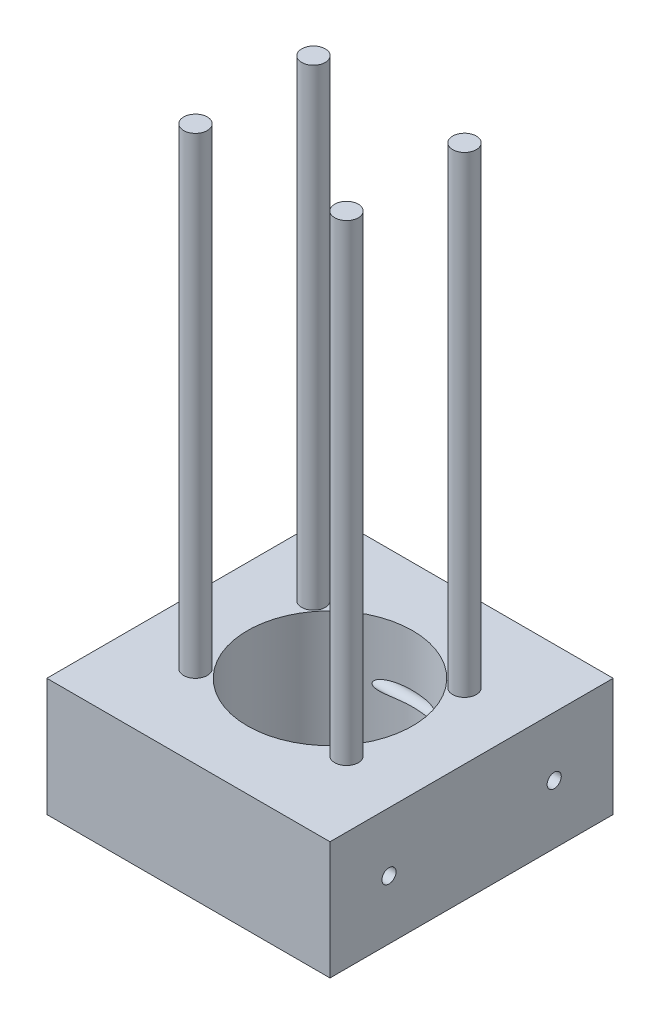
ISO-10303-21;
HEADER;
FILE_DESCRIPTION(('STEP AP214'),'2;1');
FILE_NAME('part.step','',(''),(''),'','','');
FILE_SCHEMA(('AUTOMOTIVE_DESIGN { 1 0 10303 214 1 1 1 1 }'));
ENDSEC;
DATA;
#1=APPLICATION_CONTEXT('core data for automotive mechanical design processes');
#2=APPLICATION_PROTOCOL_DEFINITION('international standard','automotive_design',2000,#1);
#3=PRODUCT_CONTEXT('',#1,'mechanical');
#4=PRODUCT('Part','Part','',(#3));
#5=PRODUCT_RELATED_PRODUCT_CATEGORY('part','',(#4));
#6=PRODUCT_DEFINITION_FORMATION('','',#4);
#7=PRODUCT_DEFINITION_CONTEXT('part definition',#1,'design');
#8=PRODUCT_DEFINITION('design','',#6,#7);
#9=PRODUCT_DEFINITION_SHAPE('','',#8);
#10=(LENGTH_UNIT() NAMED_UNIT(*) SI_UNIT(.MILLI.,.METRE.));
#11=(NAMED_UNIT(*) PLANE_ANGLE_UNIT() SI_UNIT($,.RADIAN.));
#12=(NAMED_UNIT(*) SI_UNIT($,.STERADIAN.) SOLID_ANGLE_UNIT());
#13=UNCERTAINTY_MEASURE_WITH_UNIT(LENGTH_MEASURE(1.E-05),#10,'distance_accuracy_value','');
#14=(GEOMETRIC_REPRESENTATION_CONTEXT(3) GLOBAL_UNCERTAINTY_ASSIGNED_CONTEXT((#13)) GLOBAL_UNIT_ASSIGNED_CONTEXT((#10,
#11,#12)) REPRESENTATION_CONTEXT('',''));
#15=CARTESIAN_POINT('',(0.,0.,0.));
#16=DIRECTION('',(0.,0.,1.));
#17=DIRECTION('',(1.,0.,0.));
#18=AXIS2_PLACEMENT_3D('',#15,#16,#17);
#19=CARTESIAN_POINT('',(0.,50.,120.));
#20=DIRECTION('',(0.,-1.,0.));
#21=DIRECTION('',(0.,0.,-1.));
#22=AXIS2_PLACEMENT_3D('',#19,#20,#21);
#23=PLANE('',#22);
#24=CARTESIAN_POINT('',(28.,50.,35.));
#25=DIRECTION('',(0.,-1.,0.));
#26=DIRECTION('',(0.,0.,-1.));
#27=AXIS2_PLACEMENT_3D('',#24,#25,#26);
#28=CIRCLE('',#27,5.);
#29=CARTESIAN_POINT('',(28.,50.,30.));
#30=VERTEX_POINT('',#29);
#31=EDGE_CURVE('E32',#30,#30,#28,.F.);
#32=ORIENTED_EDGE('',*,*,#31,.F.);
#33=EDGE_LOOP('',(#32));
#34=FACE_BOUND('',#33,.T.);
#35=CARTESIAN_POINT('',(92.,50.,35.));
#36=DIRECTION('',(0.,-1.,0.));
#37=DIRECTION('',(0.,0.,-1.));
#38=AXIS2_PLACEMENT_3D('',#35,#36,#37);
#39=CIRCLE('',#38,5.00000000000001);
#40=CARTESIAN_POINT('',(92.,50.,30.));
#41=VERTEX_POINT('',#40);
#42=EDGE_CURVE('E82',#41,#41,#39,.F.);
#43=ORIENTED_EDGE('',*,*,#42,.F.);
#44=EDGE_LOOP('',(#43));
#45=FACE_BOUND('',#44,.T.);
#46=CARTESIAN_POINT('',(60.,50.,60.));
#47=DIRECTION('',(0.,1.,0.));
#48=DIRECTION('',(0.,0.,1.));
#49=AXIS2_PLACEMENT_3D('',#46,#47,#48);
#50=CIRCLE('',#49,35.);
#51=CARTESIAN_POINT('',(60.,50.,95.));
#52=VERTEX_POINT('',#51);
#53=EDGE_CURVE('E90',#52,#52,#50,.T.);
#54=ORIENTED_EDGE('',*,*,#53,.F.);
#55=EDGE_LOOP('',(#54));
#56=FACE_BOUND('',#55,.T.);
#57=DIRECTION('',(-1.,0.,0.));
#58=VECTOR('',#57,1.);
#59=CARTESIAN_POINT('',(0.,50.,0.));
#60=LINE('',#59,#58);
#61=CARTESIAN_POINT('',(120.,50.,0.));
#62=VERTEX_POINT('',#61);
#63=CARTESIAN_POINT('',(0.,50.,0.));
#64=VERTEX_POINT('',#63);
#65=EDGE_CURVE('E95',#62,#64,#60,.T.);
#66=ORIENTED_EDGE('',*,*,#65,.T.);
#67=DIRECTION('',(0.,0.,-1.));
#68=VECTOR('',#67,1.);
#69=CARTESIAN_POINT('',(0.,50.,120.));
#70=LINE('',#69,#68);
#71=CARTESIAN_POINT('',(0.,50.,120.));
#72=VERTEX_POINT('',#71);
#73=EDGE_CURVE('E86',#72,#64,#70,.T.);
#74=ORIENTED_EDGE('',*,*,#73,.F.);
#75=DIRECTION('',(-1.,0.,0.));
#76=VECTOR('',#75,1.);
#77=CARTESIAN_POINT('',(0.,50.,120.));
#78=LINE('',#77,#76);
#79=CARTESIAN_POINT('',(120.,50.,120.));
#80=VERTEX_POINT('',#79);
#81=EDGE_CURVE('E39',#80,#72,#78,.T.);
#82=ORIENTED_EDGE('',*,*,#81,.F.);
#83=DIRECTION('',(0.,0.,-1.));
#84=VECTOR('',#83,1.);
#85=CARTESIAN_POINT('',(120.,50.,120.));
#86=LINE('',#85,#84);
#87=EDGE_CURVE('E103',#80,#62,#86,.T.);
#88=ORIENTED_EDGE('',*,*,#87,.T.);
#89=EDGE_LOOP('',(#66,#74,#82,#88));
#90=FACE_BOUND('',#89,.T.);
#91=CARTESIAN_POINT('',(92.,50.,85.));
#92=DIRECTION('',(0.,-1.,0.));
#93=DIRECTION('',(0.,0.,-1.));
#94=AXIS2_PLACEMENT_3D('',#91,#92,#93);
#95=CIRCLE('',#94,5.00000000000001);
#96=CARTESIAN_POINT('',(92.,50.,80.));
#97=VERTEX_POINT('',#96);
#98=EDGE_CURVE('E109',#97,#97,#95,.F.);
#99=ORIENTED_EDGE('',*,*,#98,.F.);
#100=EDGE_LOOP('',(#99));
#101=FACE_BOUND('',#100,.T.);
#102=CARTESIAN_POINT('',(28.,50.,85.));
#103=DIRECTION('',(0.,-1.,0.));
#104=DIRECTION('',(0.,0.,-1.));
#105=AXIS2_PLACEMENT_3D('',#102,#103,#104);
#106=CIRCLE('',#105,5.);
#107=CARTESIAN_POINT('',(28.,50.,80.));
#108=VERTEX_POINT('',#107);
#109=EDGE_CURVE('E11',#108,#108,#106,.F.);
#110=ORIENTED_EDGE('',*,*,#109,.F.);
#111=EDGE_LOOP('',(#110));
#112=FACE_BOUND('',#111,.T.);
#113=ADVANCED_FACE('F24',(#34,#45,#56,#90,#101,#112),#23,.F.);
#114=CARTESIAN_POINT('',(0.,0.,120.));
#115=DIRECTION('',(1.,0.,0.));
#116=DIRECTION('',(0.,0.,-1.));
#117=AXIS2_PLACEMENT_3D('',#114,#115,#116);
#118=PLANE('',#117);
#119=CARTESIAN_POINT('',(0.,25.,25.));
#120=DIRECTION('',(-1.,0.,0.));
#121=DIRECTION('',(0.,0.,-1.));
#122=AXIS2_PLACEMENT_3D('',#119,#120,#121);
#123=CIRCLE('',#122,10.);
#124=CARTESIAN_POINT('',(0.,25.,15.));
#125=VERTEX_POINT('',#124);
#126=EDGE_CURVE('E200',#125,#125,#123,.T.);
#127=ORIENTED_EDGE('',*,*,#126,.F.);
#128=EDGE_LOOP('',(#127));
#129=FACE_BOUND('',#128,.T.);
#130=CARTESIAN_POINT('',(0.,25.,95.));
#131=DIRECTION('',(-1.,0.,0.));
#132=DIRECTION('',(0.,0.,1.));
#133=AXIS2_PLACEMENT_3D('',#130,#131,#132);
#134=CIRCLE('',#133,9.99999999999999);
#135=CARTESIAN_POINT('',(0.,25.,105.));
#136=VERTEX_POINT('',#135);
#137=EDGE_CURVE('E207',#136,#136,#134,.T.);
#138=ORIENTED_EDGE('',*,*,#137,.F.);
#139=EDGE_LOOP('',(#138));
#140=FACE_BOUND('',#139,.T.);
#141=DIRECTION('',(0.,-1.,0.));
#142=VECTOR('',#141,1.);
#143=CARTESIAN_POINT('',(0.,0.,0.));
#144=LINE('',#143,#142);
#145=CARTESIAN_POINT('',(0.,0.,0.));
#146=VERTEX_POINT('',#145);
#147=EDGE_CURVE('E70',#64,#146,#144,.T.);
#148=ORIENTED_EDGE('',*,*,#147,.T.);
#149=DIRECTION('',(0.,0.,-1.));
#150=VECTOR('',#149,1.);
#151=CARTESIAN_POINT('',(0.,0.,120.));
#152=LINE('',#151,#150);
#153=CARTESIAN_POINT('',(0.,0.,120.));
#154=VERTEX_POINT('',#153);
#155=EDGE_CURVE('E77',#154,#146,#152,.T.);
#156=ORIENTED_EDGE('',*,*,#155,.F.);
#157=DIRECTION('',(0.,-1.,0.));
#158=VECTOR('',#157,1.);
#159=CARTESIAN_POINT('',(0.,0.,120.));
#160=LINE('',#159,#158);
#161=EDGE_CURVE('E97',#72,#154,#160,.T.);
#162=ORIENTED_EDGE('',*,*,#161,.F.);
#163=ORIENTED_EDGE('',*,*,#73,.T.);
#164=EDGE_LOOP('',(#148,#156,#162,#163));
#165=FACE_BOUND('',#164,.T.);
#166=ADVANCED_FACE('F26',(#129,#140,#165),#118,.F.);
#167=CARTESIAN_POINT('',(0.,0.,120.));
#168=DIRECTION('',(0.,1.,0.));
#169=DIRECTION('',(0.,0.,1.));
#170=AXIS2_PLACEMENT_3D('',#167,#168,#169);
#171=PLANE('',#170);
#172=CARTESIAN_POINT('',(60.,0.,60.));
#173=DIRECTION('',(0.,1.,0.));
#174=DIRECTION('',(0.,0.,1.));
#175=AXIS2_PLACEMENT_3D('',#172,#173,#174);
#176=CIRCLE('',#175,35.);
#177=CARTESIAN_POINT('',(60.,0.,95.));
#178=VERTEX_POINT('',#177);
#179=EDGE_CURVE('E87',#178,#178,#176,.T.);
#180=ORIENTED_EDGE('',*,*,#179,.T.);
#181=EDGE_LOOP('',(#180));
#182=FACE_BOUND('',#181,.T.);
#183=DIRECTION('',(1.,0.,0.));
#184=VECTOR('',#183,1.);
#185=CARTESIAN_POINT('',(0.,0.,0.));
#186=LINE('',#185,#184);
#187=CARTESIAN_POINT('',(120.,0.,0.));
#188=VERTEX_POINT('',#187);
#189=EDGE_CURVE('E65',#146,#188,#186,.T.);
#190=ORIENTED_EDGE('',*,*,#189,.T.);
#191=DIRECTION('',(0.,0.,-1.));
#192=VECTOR('',#191,1.);
#193=CARTESIAN_POINT('',(120.,0.,120.));
#194=LINE('',#193,#192);
#195=CARTESIAN_POINT('',(120.,0.,120.));
#196=VERTEX_POINT('',#195);
#197=EDGE_CURVE('E83',#196,#188,#194,.T.);
#198=ORIENTED_EDGE('',*,*,#197,.F.);
#199=DIRECTION('',(1.,0.,0.));
#200=VECTOR('',#199,1.);
#201=CARTESIAN_POINT('',(0.,0.,120.));
#202=LINE('',#201,#200);
#203=EDGE_CURVE('E79',#154,#196,#202,.T.);
#204=ORIENTED_EDGE('',*,*,#203,.F.);
#205=ORIENTED_EDGE('',*,*,#155,.T.);
#206=EDGE_LOOP('',(#190,#198,#204,#205));
#207=FACE_BOUND('',#206,.T.);
#208=ADVANCED_FACE('F78',(#182,#207),#171,.F.);
#209=CARTESIAN_POINT('',(120.,0.,120.));
#210=DIRECTION('',(-1.,0.,0.));
#211=DIRECTION('',(0.,0.,1.));
#212=AXIS2_PLACEMENT_3D('',#209,#210,#211);
#213=PLANE('',#212);
#214=CARTESIAN_POINT('',(120.,25.,95.));
#215=DIRECTION('',(-1.,0.,0.));
#216=DIRECTION('',(0.,0.,1.));
#217=AXIS2_PLACEMENT_3D('',#214,#215,#216);
#218=CIRCLE('',#217,3.00000000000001);
#219=CARTESIAN_POINT('',(120.,25.,98.));
#220=VERTEX_POINT('',#219);
#221=EDGE_CURVE('E181',#220,#220,#218,.T.);
#222=ORIENTED_EDGE('',*,*,#221,.T.);
#223=EDGE_LOOP('',(#222));
#224=FACE_BOUND('',#223,.T.);
#225=CARTESIAN_POINT('',(120.,25.,25.));
#226=DIRECTION('',(-1.,0.,0.));
#227=DIRECTION('',(0.,0.,1.));
#228=AXIS2_PLACEMENT_3D('',#225,#226,#227);
#229=CIRCLE('',#228,3.);
#230=CARTESIAN_POINT('',(120.,25.,28.));
#231=VERTEX_POINT('',#230);
#232=EDGE_CURVE('E201',#231,#231,#229,.T.);
#233=ORIENTED_EDGE('',*,*,#232,.T.);
#234=EDGE_LOOP('',(#233));
#235=FACE_BOUND('',#234,.T.);
#236=DIRECTION('',(0.,1.,0.));
#237=VECTOR('',#236,1.);
#238=CARTESIAN_POINT('',(120.,0.,0.));
#239=LINE('',#238,#237);
#240=EDGE_CURVE('E71',#188,#62,#239,.T.);
#241=ORIENTED_EDGE('',*,*,#240,.T.);
#242=ORIENTED_EDGE('',*,*,#87,.F.);
#243=DIRECTION('',(0.,1.,0.));
#244=VECTOR('',#243,1.);
#245=CARTESIAN_POINT('',(120.,0.,120.));
#246=LINE('',#245,#244);
#247=EDGE_CURVE('E44',#196,#80,#246,.T.);
#248=ORIENTED_EDGE('',*,*,#247,.F.);
#249=ORIENTED_EDGE('',*,*,#197,.T.);
#250=EDGE_LOOP('',(#241,#242,#248,#249));
#251=FACE_BOUND('',#250,.T.);
#252=ADVANCED_FACE('F226',(#224,#235,#251),#213,.F.);
#253=CARTESIAN_POINT('',(0.,50.,120.));
#254=DIRECTION('',(0.,0.,-1.));
#255=DIRECTION('',(-1.,0.,0.));
#256=AXIS2_PLACEMENT_3D('',#253,#254,#255);
#257=PLANE('',#256);
#258=ORIENTED_EDGE('',*,*,#161,.T.);
#259=ORIENTED_EDGE('',*,*,#203,.T.);
#260=ORIENTED_EDGE('',*,*,#247,.T.);
#261=ORIENTED_EDGE('',*,*,#81,.T.);
#262=EDGE_LOOP('',(#258,#259,#260,#261));
#263=FACE_BOUND('',#262,.T.);
#264=ADVANCED_FACE('F288',(#263),#257,.F.);
#265=CARTESIAN_POINT('',(0.,50.,0.));
#266=DIRECTION('',(0.,0.,-1.));
#267=DIRECTION('',(-1.,0.,0.));
#268=AXIS2_PLACEMENT_3D('',#265,#266,#267);
#269=PLANE('',#268);
#270=ORIENTED_EDGE('',*,*,#147,.F.);
#271=ORIENTED_EDGE('',*,*,#65,.F.);
#272=ORIENTED_EDGE('',*,*,#240,.F.);
#273=ORIENTED_EDGE('',*,*,#189,.F.);
#274=EDGE_LOOP('',(#270,#271,#272,#273));
#275=FACE_BOUND('',#274,.T.);
#276=ADVANCED_FACE('F67',(#275),#269,.T.);
#277=CARTESIAN_POINT('',(60.,0.,60.));
#278=DIRECTION('',(0.,1.,0.));
#279=DIRECTION('',(0.,0.,1.));
#280=AXIS2_PLACEMENT_3D('',#277,#278,#279);
#281=CYLINDRICAL_SURFACE('',#280,35.);
#282=CARTESIAN_POINT('',(60.,22.,95.));
#283=CARTESIAN_POINT('',(60.501205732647,21.9999918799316,94.9999995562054));
#284=CARTESIAN_POINT('',(61.0024392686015,21.9999400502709,94.989231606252));
#285=CARTESIAN_POINT('',(62.0040108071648,22.0004076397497,94.9461761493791));
#286=CARTESIAN_POINT('',(62.5043487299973,22.000927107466,94.913886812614));
#287=CARTESIAN_POINT('',(63.5057428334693,22.0046433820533,94.8276274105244));
#288=CARTESIAN_POINT('',(64.0067894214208,22.0078539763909,94.7735464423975));
#289=CARTESIAN_POINT('',(65.0059099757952,22.020501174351,94.6438234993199));
#290=CARTESIAN_POINT('',(65.5039847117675,22.0299360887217,94.5681873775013));
#291=CARTESIAN_POINT('',(66.2504415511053,22.0527265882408,94.4383017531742));
#292=CARTESIAN_POINT('',(66.5003580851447,22.0618284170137,94.3920035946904));
#293=CARTESIAN_POINT('',(66.9989587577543,22.0838194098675,94.2940098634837));
#294=CARTESIAN_POINT('',(67.2476429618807,22.0967083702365,94.2423145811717));
#295=CARTESIAN_POINT('',(67.743875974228,22.1273001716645,94.1335171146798));
#296=CARTESIAN_POINT('',(67.9914228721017,22.1450092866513,94.0764079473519));
#297=CARTESIAN_POINT('',(68.4847347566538,22.1864570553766,93.9569385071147));
#298=CARTESIAN_POINT('',(68.7304998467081,22.2101953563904,93.8945785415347));
#299=CARTESIAN_POINT('',(69.2174349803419,22.2649278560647,93.7653922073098));
#300=CARTESIAN_POINT('',(69.4586264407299,22.2958482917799,93.6986158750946));
#301=CARTESIAN_POINT('',(69.9383605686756,22.3668996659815,93.560263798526));
#302=CARTESIAN_POINT('',(70.1769025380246,22.407032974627,93.4886868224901));
#303=CARTESIAN_POINT('',(70.6498162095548,22.4987499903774,93.3413048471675));
#304=CARTESIAN_POINT('',(70.8841967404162,22.5503052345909,93.2655107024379));
#305=CARTESIAN_POINT('',(71.3479393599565,22.6680243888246,93.110178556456));
#306=CARTESIAN_POINT('',(71.57730497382,22.7341776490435,93.0306433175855));
#307=CARTESIAN_POINT('',(71.8835423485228,22.8368810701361,92.9209473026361));
#308=CARTESIAN_POINT('',(71.963630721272,22.8651127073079,92.8919247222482));
#309=CARTESIAN_POINT('',(72.1227067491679,22.9242929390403,92.833628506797));
#310=CARTESIAN_POINT('',(72.2016943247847,22.9552417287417,92.8043548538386));
#311=CARTESIAN_POINT('',(72.4374786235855,23.0529087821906,92.716009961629));
#312=CARTESIAN_POINT('',(72.592359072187,23.1242068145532,92.6566794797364));
#313=CARTESIAN_POINT('',(72.8386176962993,23.2529307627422,92.5604114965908));
#314=CARTESIAN_POINT('',(72.9323299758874,23.3057601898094,92.5232935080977));
#315=CARTESIAN_POINT('',(73.1157704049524,23.4186154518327,92.4497506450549));
#316=CARTESIAN_POINT('',(73.2054955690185,23.478646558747,92.413326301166));
#317=CARTESIAN_POINT('',(73.3788317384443,23.6067145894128,92.3421641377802));
#318=CARTESIAN_POINT('',(73.4624784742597,23.6746973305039,92.3074169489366));
#319=CARTESIAN_POINT('',(73.6219234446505,23.8203226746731,92.2405123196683));
#320=CARTESIAN_POINT('',(73.6977374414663,23.8979451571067,92.2083497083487));
#321=CARTESIAN_POINT('',(73.8201362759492,24.0429903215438,92.1559804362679));
#322=CARTESIAN_POINT('',(73.8692323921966,24.1079283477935,92.1348221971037));
#323=CARTESIAN_POINT('',(73.9591588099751,24.2443514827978,92.0958608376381));
#324=CARTESIAN_POINT('',(73.9999879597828,24.3158375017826,92.0780581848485));
#325=CARTESIAN_POINT('',(74.0711412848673,24.4659604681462,92.0469112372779));
#326=CARTESIAN_POINT('',(74.1013379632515,24.544670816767,92.0336211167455));
#327=CARTESIAN_POINT('',(74.1475498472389,24.7069108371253,92.013239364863));
#328=CARTESIAN_POINT('',(74.1635901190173,24.7904317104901,92.0061367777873));
#329=CARTESIAN_POINT('',(74.1787691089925,24.9513948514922,91.9994151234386));
#330=CARTESIAN_POINT('',(74.1793506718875,25.0286733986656,91.9991572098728));
#331=CARTESIAN_POINT('',(74.1671934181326,25.1819681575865,92.0045414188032));
#332=CARTESIAN_POINT('',(74.1544504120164,25.2579839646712,92.0101853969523));
#333=CARTESIAN_POINT('',(74.1188616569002,25.399080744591,92.0258968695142));
#334=CARTESIAN_POINT('',(74.0971217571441,25.4645053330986,92.035479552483));
#335=CARTESIAN_POINT('',(74.0454828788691,25.5913498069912,92.058153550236));
#336=CARTESIAN_POINT('',(74.015582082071,25.6527687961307,92.0712456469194));
#337=CARTESIAN_POINT('',(73.9267199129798,25.8112835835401,92.1099690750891));
#338=CARTESIAN_POINT('',(73.8617826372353,25.9044086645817,92.1380918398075));
#339=CARTESIAN_POINT('',(73.7193800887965,26.0787863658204,92.1991404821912));
#340=CARTESIAN_POINT('',(73.641874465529,26.1599990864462,92.2320817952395));
#341=CARTESIAN_POINT('',(73.4865449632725,26.3043612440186,92.2973605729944));
#342=CARTESIAN_POINT('',(73.4095159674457,26.3685034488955,92.3294335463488));
#343=CARTESIAN_POINT('',(73.2504168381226,26.4894760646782,92.3949666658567));
#344=CARTESIAN_POINT('',(73.1683424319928,26.5463001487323,92.4284279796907));
#345=CARTESIAN_POINT('',(73.0003315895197,26.6537101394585,92.4961474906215));
#346=CARTESIAN_POINT('',(72.9143885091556,26.704284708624,92.53040700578));
#347=CARTESIAN_POINT('',(72.7396750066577,26.7999299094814,92.599225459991));
#348=CARTESIAN_POINT('',(72.6509054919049,26.8450022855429,92.6337843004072));
#349=CARTESIAN_POINT('',(72.4364814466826,26.9468426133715,92.7162301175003));
#350=CARTESIAN_POINT('',(72.3097935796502,27.0014255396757,92.7641219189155));
#351=CARTESIAN_POINT('',(72.0531926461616,27.1030018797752,92.8593868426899));
#352=CARTESIAN_POINT('',(71.9232781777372,27.1499919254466,92.9067597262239));
#353=CARTESIAN_POINT('',(71.660796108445,27.2376044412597,93.000686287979));
#354=CARTESIAN_POINT('',(71.5282247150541,27.2782169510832,93.0472385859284));
#355=CARTESIAN_POINT('',(71.2611252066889,27.3539315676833,93.139206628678));
#356=CARTESIAN_POINT('',(71.1265968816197,27.3890330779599,93.1846222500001));
#357=CARTESIAN_POINT('',(70.8553421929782,27.4546317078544,93.2743452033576));
#358=CARTESIAN_POINT('',(70.7186085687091,27.4851069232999,93.3186464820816));
#359=CARTESIAN_POINT('',(70.4438232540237,27.541893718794,93.4057979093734));
#360=CARTESIAN_POINT('',(70.3057715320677,27.5682051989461,93.4486480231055));
#361=CARTESIAN_POINT('',(70.0286917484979,27.6171712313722,93.532764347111));
#362=CARTESIAN_POINT('',(69.8896647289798,27.6398292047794,93.574032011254));
#363=CARTESIAN_POINT('',(69.6106662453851,27.6819659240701,93.6549579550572));
#364=CARTESIAN_POINT('',(69.4706947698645,27.7014446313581,93.6946162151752));
#365=CARTESIAN_POINT('',(69.1290510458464,27.7454554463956,93.7891110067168));
#366=CARTESIAN_POINT('',(68.9269458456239,27.7685156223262,93.8430712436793));
#367=CARTESIAN_POINT('',(68.5213364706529,27.8098614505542,93.9474697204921));
#368=CARTESIAN_POINT('',(68.3178321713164,27.8281466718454,93.9979076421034));
#369=CARTESIAN_POINT('',(67.705438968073,27.8770805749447,94.1438473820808));
#370=CARTESIAN_POINT('',(67.2947744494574,27.9017949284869,94.2339461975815));
#371=CARTESIAN_POINT('',(66.4693172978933,27.9405100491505,94.3994988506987));
#372=CARTESIAN_POINT('',(66.0545186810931,27.9544919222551,94.4749266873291));
#373=CARTESIAN_POINT('',(65.2223644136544,27.9754345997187,94.6107585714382));
#374=CARTESIAN_POINT('',(64.8050091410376,27.9823964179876,94.6711647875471));
#375=CARTESIAN_POINT('',(63.967123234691,27.9921742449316,94.7770151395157));
#376=CARTESIAN_POINT('',(63.5465868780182,27.9949780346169,94.8224148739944));
#377=CARTESIAN_POINT('',(62.704126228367,27.9985018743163,94.8979450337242));
#378=CARTESIAN_POINT('',(62.2822018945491,27.9992218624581,94.9280750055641));
#379=CARTESIAN_POINT('',(61.4380566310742,27.999962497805,94.9729956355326));
#380=CARTESIAN_POINT('',(61.0158367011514,27.9999840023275,94.9878050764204));
#381=CARTESIAN_POINT('',(60.1711436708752,28.0000075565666,95.0021304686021));
#382=CARTESIAN_POINT('',(59.7486705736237,28.0000096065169,95.0016466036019));
#383=CARTESIAN_POINT('',(58.8811225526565,27.999975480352,94.984945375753));
#384=CARTESIAN_POINT('',(58.4360637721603,27.9999372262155,94.9678766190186));
#385=CARTESIAN_POINT('',(57.5469019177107,27.9989537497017,94.9167671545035));
#386=CARTESIAN_POINT('',(57.1027988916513,27.9980084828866,94.8827256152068));
#387=CARTESIAN_POINT('',(56.2151710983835,27.9934705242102,94.7976193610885));
#388=CARTESIAN_POINT('',(55.7716502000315,27.9898715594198,94.7465144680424));
#389=CARTESIAN_POINT('',(54.8870076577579,27.9773732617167,94.6273950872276));
#390=CARTESIAN_POINT('',(54.4458857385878,27.9684745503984,94.5593825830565));
#391=CARTESIAN_POINT('',(53.5703979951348,27.9418608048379,94.4072075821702));
#392=CARTESIAN_POINT('',(53.1360064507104,27.9242190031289,94.3231827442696));
#393=CARTESIAN_POINT('',(52.4874817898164,27.8875501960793,94.1849527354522));
#394=CARTESIAN_POINT('',(52.2717500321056,27.8736202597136,94.1368268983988));
#395=CARTESIAN_POINT('',(51.8415353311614,27.841581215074,94.0365718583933));
#396=CARTESIAN_POINT('',(51.6270523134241,27.8234723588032,93.9844428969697));
#397=CARTESIAN_POINT('',(51.2004615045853,27.7822725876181,93.8764863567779));
#398=CARTESIAN_POINT('',(50.9883475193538,27.7592029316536,93.8206752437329));
#399=CARTESIAN_POINT('',(50.5659155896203,27.7069756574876,93.7052811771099));
#400=CARTESIAN_POINT('',(50.3555974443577,27.6778187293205,93.6456986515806));
#401=CARTESIAN_POINT('',(49.9373756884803,27.612142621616,93.5229926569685));
#402=CARTESIAN_POINT('',(49.729469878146,27.5756308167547,93.4598727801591));
#403=CARTESIAN_POINT('',(49.3165130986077,27.4936003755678,93.330314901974));
#404=CARTESIAN_POINT('',(49.1114612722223,27.4480845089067,93.2638779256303));
#405=CARTESIAN_POINT('',(48.8206329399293,27.3749451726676,93.1667048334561));
#406=CARTESIAN_POINT('',(48.7333140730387,27.3518586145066,93.1371427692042));
#407=CARTESIAN_POINT('',(48.559484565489,27.303386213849,93.0775308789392));
#408=CARTESIAN_POINT('',(48.4729739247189,27.278000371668,93.0474810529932));
#409=CARTESIAN_POINT('',(48.2146980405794,27.1980005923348,92.956637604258));
#410=CARTESIAN_POINT('',(48.0443165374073,27.139575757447,92.8951927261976));
#411=CARTESIAN_POINT('',(47.7087495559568,27.0101926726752,92.7712842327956));
#412=CARTESIAN_POINT('',(47.5435613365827,26.9392411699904,92.7088211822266));
#413=CARTESIAN_POINT('',(47.3016362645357,26.8209337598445,92.615319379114));
#414=CARTESIAN_POINT('',(47.2220084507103,26.7795411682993,92.584199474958));
#415=CARTESIAN_POINT('',(47.0651652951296,26.6922341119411,92.5222561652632));
#416=CARTESIAN_POINT('',(46.9879492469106,26.6463209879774,92.491432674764));
#417=CARTESIAN_POINT('',(46.8355211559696,26.5486610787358,92.429975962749));
#418=CARTESIAN_POINT('',(46.7603510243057,26.4968430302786,92.3993511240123));
#419=CARTESIAN_POINT('',(46.6141433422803,26.3871394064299,92.3392189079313));
#420=CARTESIAN_POINT('',(46.5431029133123,26.3292581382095,92.3097107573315));
#421=CARTESIAN_POINT('',(46.4069412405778,26.2069206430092,92.2526613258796));
#422=CARTESIAN_POINT('',(46.3417834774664,26.1425111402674,92.2251081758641));
#423=CARTESIAN_POINT('',(46.21893148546,26.0060086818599,92.1727616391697));
#424=CARTESIAN_POINT('',(46.1612234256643,25.933930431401,92.1479631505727));
#425=CARTESIAN_POINT('',(46.0654143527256,25.7950596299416,92.1065343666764));
#426=CARTESIAN_POINT('',(46.0256525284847,25.7296269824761,92.0892364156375));
#427=CARTESIAN_POINT('',(45.9550561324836,25.5931902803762,92.0584004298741));
#428=CARTESIAN_POINT('',(45.9242205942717,25.522186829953,92.0448619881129));
#429=CARTESIAN_POINT('',(45.8735440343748,25.3747296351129,92.0225550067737));
#430=CARTESIAN_POINT('',(45.8538160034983,25.2982285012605,92.0138355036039));
#431=CARTESIAN_POINT('',(45.8279098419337,25.1425396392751,92.0023761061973));
#432=CARTESIAN_POINT('',(45.8217159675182,25.0633551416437,91.9996292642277));
#433=CARTESIAN_POINT('',(45.8234906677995,24.9124764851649,92.0004152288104));
#434=CARTESIAN_POINT('',(45.8302125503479,24.8407613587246,92.00339525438));
#435=CARTESIAN_POINT('',(45.8547173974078,24.6996346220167,92.0142336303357));
#436=CARTESIAN_POINT('',(45.8725077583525,24.6302245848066,92.0220952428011));
#437=CARTESIAN_POINT('',(45.9234710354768,24.4778995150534,92.0445358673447));
#438=CARTESIAN_POINT('',(45.959423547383,24.3961028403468,92.0603225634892));
#439=CARTESIAN_POINT('',(46.042955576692,24.2398969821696,92.0967754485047));
#440=CARTESIAN_POINT('',(46.090558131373,24.1655028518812,92.1174513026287));
#441=CARTESIAN_POINT('',(46.2242471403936,23.9833395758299,92.1750909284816));
#442=CARTESIAN_POINT('',(46.3166893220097,23.8810848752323,92.2145686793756));
#443=CARTESIAN_POINT('',(46.5146958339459,23.6924651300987,92.297960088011));
#444=CARTESIAN_POINT('',(46.6202931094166,23.6061413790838,92.3418848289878));
#445=CARTESIAN_POINT('',(46.8381295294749,23.4478905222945,92.4311394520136));
#446=CARTESIAN_POINT('',(46.9502298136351,23.375748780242,92.4764340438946));
#447=CARTESIAN_POINT('',(47.180158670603,23.2417657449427,92.5678831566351));
#448=CARTESIAN_POINT('',(47.2979928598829,23.179934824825,92.6140384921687));
#449=CARTESIAN_POINT('',(47.5379745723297,23.064729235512,92.7064901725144));
#450=CARTESIAN_POINT('',(47.6601308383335,23.0113730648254,92.7527866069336));
#451=CARTESIAN_POINT('',(47.9074360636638,22.9119103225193,92.8448979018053));
#452=CARTESIAN_POINT('',(48.0325837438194,22.8658007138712,92.890712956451));
#453=CARTESIAN_POINT('',(48.3514072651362,22.7571381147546,93.0053342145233));
#454=CARTESIAN_POINT('',(48.5466450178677,22.6986213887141,93.0736143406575));
#455=CARTESIAN_POINT('',(48.9410578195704,22.5928256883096,93.2075781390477));
#456=CARTESIAN_POINT('',(49.1402347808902,22.5455523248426,93.2732605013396));
#457=CARTESIAN_POINT('',(49.5418326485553,22.4600625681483,93.4016654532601));
#458=CARTESIAN_POINT('',(49.7442585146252,22.4218617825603,93.4643827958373));
#459=CARTESIAN_POINT('',(50.1513925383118,22.3529630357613,93.5864572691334));
#460=CARTESIAN_POINT('',(50.3561009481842,22.3222659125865,93.6458140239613));
#461=CARTESIAN_POINT('',(50.7682222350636,22.2669531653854,93.761224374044));
#462=CARTESIAN_POINT('',(50.9756429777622,22.242364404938,93.8172625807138));
#463=CARTESIAN_POINT('',(51.3919958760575,22.1983660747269,93.9256325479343));
#464=CARTESIAN_POINT('',(51.6009280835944,22.1789566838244,93.9779641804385));
#465=CARTESIAN_POINT('',(52.0198540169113,22.1444440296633,94.0787858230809));
#466=CARTESIAN_POINT('',(52.2298465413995,22.1293366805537,94.1272794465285));
#467=CARTESIAN_POINT('',(52.6509063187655,22.1026557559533,94.2204225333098));
#468=CARTESIAN_POINT('',(52.8619735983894,22.0910822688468,94.2650719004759));
#469=CARTESIAN_POINT('',(53.3584946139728,22.0673085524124,94.3653158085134));
#470=CARTESIAN_POINT('',(53.6443253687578,22.0562865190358,94.419326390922));
#471=CARTESIAN_POINT('',(54.2173676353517,22.0381698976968,94.5202232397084));
#472=CARTESIAN_POINT('',(54.5045791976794,22.0310754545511,94.5671092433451));
#473=CARTESIAN_POINT('',(55.0802316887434,22.0197313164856,94.6537245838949));
#474=CARTESIAN_POINT('',(55.3686729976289,22.0154825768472,94.6934515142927));
#475=CARTESIAN_POINT('',(55.946490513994,22.0089436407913,94.7656991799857));
#476=CARTESIAN_POINT('',(56.235866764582,22.0066535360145,94.7982195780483));
#477=CARTESIAN_POINT('',(56.8142138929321,22.0033232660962,94.8559161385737));
#478=CARTESIAN_POINT('',(57.1031819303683,22.0022782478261,94.8811205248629));
#479=CARTESIAN_POINT('',(57.6816439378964,22.0008764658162,94.9243374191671));
#480=CARTESIAN_POINT('',(57.9711378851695,22.0005196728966,94.9423502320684));
#481=CARTESIAN_POINT('',(58.5504393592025,22.0001035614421,94.9711718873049));
#482=CARTESIAN_POINT('',(58.840246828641,22.0000441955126,94.9819818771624));
#483=CARTESIAN_POINT('',(59.4200330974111,21.999994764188,94.99639602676));
#484=CARTESIAN_POINT('',(59.7100118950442,22.0000046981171,95.0000002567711));
#485=CARTESIAN_POINT('',(60.,22.,95.));
#486=B_SPLINE_CURVE_WITH_KNOTS('',3,(#282,#283,#284,#285,#286,#287,#288,#289,#290,#291,#292,
#293,#294,#295,#296,#297,#298,#299,#300,#301,#302,#303,#304,#305,#306,#307,#308,#309,#310,#311,
#312,#313,#314,#315,#316,#317,#318,#319,#320,#321,#322,#323,#324,#325,#326,#327,#328,#329,#330,
#331,#332,#333,#334,#335,#336,#337,#338,#339,#340,#341,#342,#343,#344,#345,#346,#347,#348,#349,
#350,#351,#352,#353,#354,#355,#356,#357,#358,#359,#360,#361,#362,#363,#364,#365,#366,#367,#368,
#369,#370,#371,#372,#373,#374,#375,#376,#377,#378,#379,#380,#381,#382,#383,#384,#385,#386,#387,
#388,#389,#390,#391,#392,#393,#394,#395,#396,#397,#398,#399,#400,#401,#402,#403,#404,#405,#406,
#407,#408,#409,#410,#411,#412,#413,#414,#415,#416,#417,#418,#419,#420,#421,#422,#423,#424,#425,
#426,#427,#428,#429,#430,#431,#432,#433,#434,#435,#436,#437,#438,#439,#440,#441,#442,#443,#444,
#445,#446,#447,#448,#449,#450,#451,#452,#453,#454,#455,#456,#457,#458,#459,#460,#461,#462,#463,
#464,#465,#466,#467,#468,#469,#470,#471,#472,#473,#474,#475,#476,#477,#478,#479,#480,#481,#482,
#483,#484,#485),.UNSPECIFIED.,.T.,.F.,(4,2,2,2,2,2,2,2,2,2,2,2,2,2,2,2,2,2,2,2,2,2,2,2,2,2,2,2,
2,2,2,2,2,2,2,2,2,2,2,2,2,2,2,2,2,2,2,2,2,2,2,2,2,2,2,2,2,2,2,2,2,2,2,2,2,2,2,2,2,2,2,2,2,2,2,2,
2,2,2,2,2,2,2,2,2,2,2,2,2,2,2,2,2,2,2,2,2,2,2,2,2,4),(0.,1.50355063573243,3.00722912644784,
4.51865884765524,6.02967854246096,6.79260284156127,7.55548611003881,8.31936713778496,
9.08320348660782,9.8395171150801,10.5960255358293,11.3506695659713,12.1047648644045,
12.3739453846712,12.643145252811,13.1840006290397,13.5251786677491,13.8666080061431,
14.205833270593,14.5443620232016,14.7961273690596,15.0479277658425,15.3026522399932,
15.5569247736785,15.7873720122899,16.0178917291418,16.2259413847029,16.4340374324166,
16.7828996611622,17.1329049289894,17.4481761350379,17.76371810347,18.0798243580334,
18.3958301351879,18.8335937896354,19.271551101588,19.7101857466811,20.1488678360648,
20.5895661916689,21.030275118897,21.4705689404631,21.9108681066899,22.5421150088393,
23.1734188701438,24.4363542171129,25.7015078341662,26.9664786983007,28.2351595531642,
29.5038780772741,30.7710393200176,32.0381853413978,33.3740155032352,34.7099111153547,
36.0489747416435,37.3878813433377,38.715758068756,39.380114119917,40.0444301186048,
40.7059540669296,41.367403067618,42.0281921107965,42.6887782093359,42.9738530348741,
43.2589278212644,43.8294915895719,44.3997489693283,44.6845980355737,44.9693628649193,
45.2580264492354,45.5464863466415,45.8330106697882,46.1189951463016,46.3538360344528,
46.5886514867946,46.8258143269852,47.062701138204,47.2778639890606,47.4931707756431,
47.7638568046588,48.0350824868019,48.4628253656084,48.8916618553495,49.3134005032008,
49.7355609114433,50.1586305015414,50.581522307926,51.2259033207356,51.8706052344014,
52.516408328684,53.162283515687,53.8109507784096,54.4596404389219,55.1077119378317,
55.7557996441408,56.6289595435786,57.5021516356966,58.375636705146,59.2491626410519,
60.1192724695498,60.9893454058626,61.8592796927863,62.7292054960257),.UNSPECIFIED.);
#487=CARTESIAN_POINT('',(60.,22.,95.));
#488=VERTEX_POINT('',#487);
#489=EDGE_CURVE('E173',#488,#488,#486,.T.);
#490=ORIENTED_EDGE('',*,*,#489,.T.);
#491=EDGE_LOOP('',(#490));
#492=FACE_BOUND('',#491,.T.);
#493=CARTESIAN_POINT('',(74.1774468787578,25.,28.));
#494=CARTESIAN_POINT('',(74.1774294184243,24.9257420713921,27.9999917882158));
#495=CARTESIAN_POINT('',(74.1711473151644,24.8513627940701,27.997206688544));
#496=CARTESIAN_POINT('',(74.1466316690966,24.7049051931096,27.9863626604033));
#497=CARTESIAN_POINT('',(74.1283630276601,24.6328342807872,27.9782882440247));
#498=CARTESIAN_POINT('',(74.0764010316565,24.4775086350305,27.9554077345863));
#499=CARTESIAN_POINT('',(74.0402066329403,24.3952590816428,27.9395149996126));
#500=CARTESIAN_POINT('',(73.9560989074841,24.2382843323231,27.9028130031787));
#501=CARTESIAN_POINT('',(73.9081689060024,24.163570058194,27.8819967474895));
#502=CARTESIAN_POINT('',(73.7737951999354,23.9809928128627,27.8240699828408));
#503=CARTESIAN_POINT('',(73.681013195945,23.8786448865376,27.7844543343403));
#504=CARTESIAN_POINT('',(73.4823091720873,23.6898713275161,27.7007882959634));
#505=CARTESIAN_POINT('',(73.3763525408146,23.6034891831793,27.6567262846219));
#506=CARTESIAN_POINT('',(73.1576873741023,23.4450704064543,27.567161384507));
#507=CARTESIAN_POINT('',(73.0451090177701,23.3728320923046,27.5216914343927));
#508=CARTESIAN_POINT('',(72.8142148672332,23.23869693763,27.4299006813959));
#509=CARTESIAN_POINT('',(72.6958934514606,23.1768105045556,27.3835790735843));
#510=CARTESIAN_POINT('',(72.4549585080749,23.061536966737,27.2908161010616));
#511=CARTESIAN_POINT('',(72.3323371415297,23.0081664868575,27.2443746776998));
#512=CARTESIAN_POINT('',(72.0840996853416,22.9086949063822,27.1519850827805));
#513=CARTESIAN_POINT('',(71.9584848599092,22.8625907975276,27.1060367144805));
#514=CARTESIAN_POINT('',(71.6383802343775,22.7539272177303,26.9910580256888));
#515=CARTESIAN_POINT('',(71.4423249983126,22.6954215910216,26.9225627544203));
#516=CARTESIAN_POINT('',(71.0462725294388,22.589682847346,26.7881999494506));
#517=CARTESIAN_POINT('',(70.8462733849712,22.5424553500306,26.7223337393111));
#518=CARTESIAN_POINT('',(70.4430314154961,22.4570823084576,26.5935939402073));
#519=CARTESIAN_POINT('',(70.2397836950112,22.4189521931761,26.5307255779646));
#520=CARTESIAN_POINT('',(69.8310039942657,22.3502108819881,26.4083805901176));
#521=CARTESIAN_POINT('',(69.625471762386,22.3196005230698,26.3489043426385));
#522=CARTESIAN_POINT('',(69.2114975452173,22.2644432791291,26.2332301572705));
#523=CARTESIAN_POINT('',(69.0030459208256,22.239929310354,26.1770512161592));
#524=CARTESIAN_POINT('',(68.5846316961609,22.1960996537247,26.0684390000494));
#525=CARTESIAN_POINT('',(68.3746690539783,22.176784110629,26.0160058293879));
#526=CARTESIAN_POINT('',(67.7432729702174,22.125285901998,25.8645505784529));
#527=CARTESIAN_POINT('',(67.3199304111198,22.0995020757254,25.7712606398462));
#528=CARTESIAN_POINT('',(66.4336837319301,22.0576954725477,25.5931840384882));
#529=CARTESIAN_POINT('',(65.9704595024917,22.0426816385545,25.5097820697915));
#530=CARTESIAN_POINT('',(65.040768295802,22.0209448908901,25.3616936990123));
#531=CARTESIAN_POINT('',(64.5743007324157,22.0142235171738,25.2970107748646));
#532=CARTESIAN_POINT('',(63.6386675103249,22.005287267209,25.1864649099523));
#533=CARTESIAN_POINT('',(63.1694997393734,22.0030766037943,25.1406195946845));
#534=CARTESIAN_POINT('',(62.2297262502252,22.0005484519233,25.0679170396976));
#535=CARTESIAN_POINT('',(61.7591206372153,22.0002308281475,25.0410584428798));
#536=CARTESIAN_POINT('',(60.8181965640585,21.9999569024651,25.0064045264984));
#537=CARTESIAN_POINT('',(60.3478795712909,21.9999998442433,24.9985693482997));
#538=CARTESIAN_POINT('',(59.4072922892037,22.0000001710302,25.0018588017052));
#539=CARTESIAN_POINT('',(58.9370220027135,21.9999575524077,25.0129842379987));
#540=CARTESIAN_POINT('',(57.9976160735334,22.0004182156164,25.0541654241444));
#541=CARTESIAN_POINT('',(57.528479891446,22.0009211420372,25.0842088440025));
#542=CARTESIAN_POINT('',(56.5918555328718,22.004180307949,25.1631600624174));
#543=CARTESIAN_POINT('',(56.1243671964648,22.0069363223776,25.2120659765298));
#544=CARTESIAN_POINT('',(55.1842054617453,22.0175643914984,25.3296073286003));
#545=CARTESIAN_POINT('',(54.7115707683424,22.025518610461,25.3985495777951));
#546=CARTESIAN_POINT('',(54.0051972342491,22.0445136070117,25.5163899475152));
#547=CARTESIAN_POINT('',(53.770141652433,22.0520238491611,25.5580803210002));
#548=CARTESIAN_POINT('',(53.3010379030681,22.0700842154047,25.6462395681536));
#549=CARTESIAN_POINT('',(53.0669897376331,22.0806343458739,25.6927084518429));
#550=CARTESIAN_POINT('',(52.600397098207,22.1055335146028,25.7903140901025));
#551=CARTESIAN_POINT('',(52.3678510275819,22.1198774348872,25.8414444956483));
#552=CARTESIAN_POINT('',(51.9041744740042,22.1532908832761,25.9483596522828));
#553=CARTESIAN_POINT('',(51.6730439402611,22.1723602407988,26.0041442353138));
#554=CARTESIAN_POINT('',(51.2126062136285,22.2163131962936,26.1202413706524));
#555=CARTESIAN_POINT('',(50.9832980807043,22.2411935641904,26.1805513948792));
#556=CARTESIAN_POINT('',(50.526797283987,22.2981117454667,26.305572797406));
#557=CARTESIAN_POINT('',(50.2996043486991,22.3301486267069,26.3702836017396));
#558=CARTESIAN_POINT('',(49.8470973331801,22.403178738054,26.5041136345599));
#559=CARTESIAN_POINT('',(49.6217920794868,22.4442015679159,26.5732468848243));
#560=CARTESIAN_POINT('',(49.174574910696,22.5373458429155,26.7153901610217));
#561=CARTESIAN_POINT('',(48.9526646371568,22.5894724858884,26.7884019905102));
#562=CARTESIAN_POINT('',(48.5133441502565,22.7078066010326,26.9377778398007));
#563=CARTESIAN_POINT('',(48.2959394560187,22.7740303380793,27.0141456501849));
#564=CARTESIAN_POINT('',(47.9753153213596,22.8869729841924,27.1302584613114));
#565=CARTESIAN_POINT('',(47.8693965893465,22.9268692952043,27.1692066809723));
#566=CARTESIAN_POINT('',(47.6598137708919,23.0119096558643,27.2474078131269));
#567=CARTESIAN_POINT('',(47.5561491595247,23.0570524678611,27.2866606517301));
#568=CARTESIAN_POINT('',(47.3505198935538,23.1539756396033,27.3656175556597));
#569=CARTESIAN_POINT('',(47.2485875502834,23.2058250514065,27.4053217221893));
#570=CARTESIAN_POINT('',(47.0486236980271,23.3168200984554,27.484259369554));
#571=CARTESIAN_POINT('',(46.9505899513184,23.3759614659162,27.5234931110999));
#572=CARTESIAN_POINT('',(46.7604017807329,23.5024932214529,27.600563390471));
#573=CARTESIAN_POINT('',(46.6682125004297,23.5698259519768,27.6384075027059));
#574=CARTESIAN_POINT('',(46.4912590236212,23.7145742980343,27.71187454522));
#575=CARTESIAN_POINT('',(46.4064814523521,23.7919710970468,27.7475014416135));
#576=CARTESIAN_POINT('',(46.2696904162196,23.9355340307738,27.8055516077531));
#577=CARTESIAN_POINT('',(46.2151112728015,23.9988611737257,27.8288963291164));
#578=CARTESIAN_POINT('',(46.1134234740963,24.1323774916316,27.8726588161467));
#579=CARTESIAN_POINT('',(46.0663208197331,24.2025721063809,27.8930742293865));
#580=CARTESIAN_POINT('',(45.9817503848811,24.3507473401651,27.9299074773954));
#581=CARTESIAN_POINT('',(45.9443964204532,24.4288063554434,27.9462779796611));
#582=CARTESIAN_POINT('',(45.8833370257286,24.5910338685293,27.9731212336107));
#583=CARTESIAN_POINT('',(45.8596006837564,24.6751880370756,27.9836073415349));
#584=CARTESIAN_POINT('',(45.8317713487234,24.8292011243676,27.9959147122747));
#585=CARTESIAN_POINT('',(45.8246235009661,24.8984011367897,27.9990828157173));
#586=CARTESIAN_POINT('',(45.8212648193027,25.0371179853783,28.000570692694));
#587=CARTESIAN_POINT('',(45.8250510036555,25.106634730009,27.9988917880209));
#588=CARTESIAN_POINT('',(45.8431814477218,25.2437744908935,27.9908672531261));
#589=CARTESIAN_POINT('',(45.8574975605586,25.3114020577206,27.9845340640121));
#590=CARTESIAN_POINT('',(45.8954536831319,25.4434400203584,27.9677943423));
#591=CARTESIAN_POINT('',(45.9191006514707,25.5078479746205,27.957384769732));
#592=CARTESIAN_POINT('',(45.9869193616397,25.6614265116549,27.927652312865));
#593=CARTESIAN_POINT('',(46.0355251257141,25.7482609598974,27.9064339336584));
#594=CARTESIAN_POINT('',(46.1447499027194,25.9125472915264,27.8591290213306));
#595=CARTESIAN_POINT('',(46.205400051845,25.9899740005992,27.8330298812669));
#596=CARTESIAN_POINT('',(46.3249375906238,26.1245040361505,27.7820513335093));
#597=CARTESIAN_POINT('',(46.3826045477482,26.1828891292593,27.7576246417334));
#598=CARTESIAN_POINT('',(46.5025286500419,26.2940606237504,27.7072376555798));
#599=CARTESIAN_POINT('',(46.5647891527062,26.346842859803,27.6812762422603));
#600=CARTESIAN_POINT('',(46.6929004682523,26.447477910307,27.6283161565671));
#601=CARTESIAN_POINT('',(46.7587568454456,26.4953227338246,27.6013158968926));
#602=CARTESIAN_POINT('',(46.8932343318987,26.5865821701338,27.5466800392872));
#603=CARTESIAN_POINT('',(46.9618565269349,26.6299950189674,27.519044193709));
#604=CARTESIAN_POINT('',(47.1777456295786,26.7583774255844,27.4329234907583));
#605=CARTESIAN_POINT('',(47.3287310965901,26.8367106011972,27.3738437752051));
#606=CARTESIAN_POINT('',(47.6370259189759,26.9799142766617,27.2557754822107));
#607=CARTESIAN_POINT('',(47.7943420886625,27.0447697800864,27.1967870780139));
#608=CARTESIAN_POINT('',(48.1136728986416,27.1637222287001,27.0797296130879));
#609=CARTESIAN_POINT('',(48.2756961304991,27.2177978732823,27.0216625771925));
#610=CARTESIAN_POINT('',(48.602893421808,27.3169950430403,26.9071608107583));
#611=CARTESIAN_POINT('',(48.7680659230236,27.3621208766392,26.8507253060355));
#612=CARTESIAN_POINT('',(49.0683662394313,27.4368671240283,26.7506494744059));
#613=CARTESIAN_POINT('',(49.2030584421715,27.4677943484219,26.7066637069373));
#614=CARTESIAN_POINT('',(49.4737797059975,27.5254770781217,26.6200825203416));
#615=CARTESIAN_POINT('',(49.6098088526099,27.5522323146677,26.5774871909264));
#616=CARTESIAN_POINT('',(50.0196787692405,27.6270735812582,26.4519027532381));
#617=CARTESIAN_POINT('',(50.2952061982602,27.6697122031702,26.3711471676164));
#618=CARTESIAN_POINT('',(50.8499860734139,27.7438636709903,26.2159740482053));
#619=CARTESIAN_POINT('',(51.1292441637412,27.7753570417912,26.1415677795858));
#620=CARTESIAN_POINT('',(51.690330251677,27.8296206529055,25.9995125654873));
#621=CARTESIAN_POINT('',(51.9721585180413,27.8523899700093,25.9318643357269));
#622=CARTESIAN_POINT('',(52.5393023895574,27.8912714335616,25.8031727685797));
#623=CARTESIAN_POINT('',(52.8246284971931,27.9073484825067,25.7421654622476));
#624=CARTESIAN_POINT('',(53.3969542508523,27.9342834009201,25.6272639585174));
#625=CARTESIAN_POINT('',(53.6839539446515,27.9451411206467,25.5733699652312));
#626=CARTESIAN_POINT('',(54.2590682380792,27.9629471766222,25.472810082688));
#627=CARTESIAN_POINT('',(54.5471816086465,27.9698990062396,25.4261377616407));
#628=CARTESIAN_POINT('',(55.1245396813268,27.9809850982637,25.3400073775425));
#629=CARTESIAN_POINT('',(55.4137844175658,27.9851192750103,25.3005495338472));
#630=CARTESIAN_POINT('',(56.1913531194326,27.9936513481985,25.2043706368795));
#631=CARTESIAN_POINT('',(56.6805338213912,27.9962957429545,25.1543000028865));
#632=CARTESIAN_POINT('',(57.6606043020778,27.9993284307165,25.0748086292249));
#633=CARTESIAN_POINT('',(58.1514942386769,27.9997165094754,25.0453898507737));
#634=CARTESIAN_POINT('',(59.1345054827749,28.0000526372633,25.0072427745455));
#635=CARTESIAN_POINT('',(59.6266274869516,28.0000003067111,24.9985323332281));
#636=CARTESIAN_POINT('',(60.6107749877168,27.9999996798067,25.0018702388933));
#637=CARTESIAN_POINT('',(61.1028004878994,28.000051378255,25.0139175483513));
#638=CARTESIAN_POINT('',(62.0836349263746,27.9995098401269,25.0586440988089));
#639=CARTESIAN_POINT('',(62.5724482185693,27.9989195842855,25.0912276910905));
#640=CARTESIAN_POINT('',(63.5483163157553,27.9950870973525,25.1768840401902));
#641=CARTESIAN_POINT('',(64.0353709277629,27.9918445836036,25.2299589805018));
#642=CARTESIAN_POINT('',(65.0062609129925,27.979431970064,25.3564336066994));
#643=CARTESIAN_POINT('',(65.4900992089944,27.9702683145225,25.4298111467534));
#644=CARTESIAN_POINT('',(66.2129120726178,27.9485188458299,25.5549782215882));
#645=CARTESIAN_POINT('',(66.4533359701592,27.9399362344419,25.5992123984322));
#646=CARTESIAN_POINT('',(66.9330584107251,27.9193317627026,25.6926771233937));
#647=CARTESIAN_POINT('',(67.1723570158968,27.9073100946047,25.7419073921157));
#648=CARTESIAN_POINT('',(67.6061481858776,27.8815284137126,25.8358903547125));
#649=CARTESIAN_POINT('',(67.8008608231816,27.8684841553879,25.8798246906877));
#650=CARTESIAN_POINT('',(68.1892520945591,27.8389334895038,25.9709545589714));
#651=CARTESIAN_POINT('',(68.3829307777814,27.8224272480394,26.0181499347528));
#652=CARTESIAN_POINT('',(68.7693307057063,27.7852667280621,26.1158060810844));
#653=CARTESIAN_POINT('',(68.9620504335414,27.7646072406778,26.1662708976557));
#654=CARTESIAN_POINT('',(69.34605409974,27.7183655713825,26.2703269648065));
#655=CARTESIAN_POINT('',(69.5373380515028,27.6927834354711,26.3239181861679));
#656=CARTESIAN_POINT('',(69.9399170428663,27.6324961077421,26.4403989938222));
#657=CARTESIAN_POINT('',(70.151002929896,27.5970827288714,26.5036515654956));
#658=CARTESIAN_POINT('',(70.5704021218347,27.5173553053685,26.6336280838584));
#659=CARTESIAN_POINT('',(70.7787158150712,27.4730425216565,26.7003515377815));
#660=CARTESIAN_POINT('',(71.1912005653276,27.37352604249,26.8367055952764));
#661=CARTESIAN_POINT('',(71.3953805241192,27.3183493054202,26.9063286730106));
#662=CARTESIAN_POINT('',(71.7986270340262,27.1942688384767,27.0479446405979));
#663=CARTESIAN_POINT('',(71.9976971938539,27.1253751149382,27.1199357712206));
#664=CARTESIAN_POINT('',(72.339181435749,26.9894678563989,27.2468480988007));
#665=CARTESIAN_POINT('',(72.4832369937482,26.9263511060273,27.3015017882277));
#666=CARTESIAN_POINT('',(72.7658038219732,26.7877282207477,27.4107816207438));
#667=CARTESIAN_POINT('',(72.9043048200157,26.7122003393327,27.4654075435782));
#668=CARTESIAN_POINT('',(73.1060571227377,26.5869368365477,27.5463926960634));
#669=CARTESIAN_POINT('',(73.1726296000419,26.5429333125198,27.5733628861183));
#670=CARTESIAN_POINT('',(73.3028956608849,26.4504805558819,27.6265864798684));
#671=CARTESIAN_POINT('',(73.366590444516,26.4020332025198,27.6528401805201));
#672=CARTESIAN_POINT('',(73.4901623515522,26.3002498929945,27.7041800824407));
#673=CARTESIAN_POINT('',(73.5500493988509,26.2469276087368,27.7292692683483));
#674=CARTESIAN_POINT('',(73.66504202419,26.1347202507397,27.7777946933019));
#675=CARTESIAN_POINT('',(73.7201518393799,26.0758402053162,27.8012323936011));
#676=CARTESIAN_POINT('',(73.8258278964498,25.9498774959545,27.8464638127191));
#677=CARTESIAN_POINT('',(73.876187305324,25.8825899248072,27.8681789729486));
#678=CARTESIAN_POINT('',(73.9679701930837,25.7410140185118,27.9079711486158));
#679=CARTESIAN_POINT('',(74.0093898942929,25.6667227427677,27.9260466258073));
#680=CARTESIAN_POINT('',(74.080828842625,25.5104421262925,27.9573438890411));
#681=CARTESIAN_POINT('',(74.1106794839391,25.4283591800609,27.9704938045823));
#682=CARTESIAN_POINT('',(74.1547643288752,25.2594661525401,27.9899505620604));
#683=CARTESIAN_POINT('',(74.1690670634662,25.1726786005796,27.9962874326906));
#684=CARTESIAN_POINT('',(74.1765376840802,25.0569762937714,27.9995973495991));
#685=CARTESIAN_POINT('',(74.1774535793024,25.0284970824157,28.0000031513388));
#686=CARTESIAN_POINT('',(74.1774468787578,25.,28.));
#687=B_SPLINE_CURVE_WITH_KNOTS('',3,(#493,#494,#495,#496,#497,#498,#499,#500,#501,#502,#503,
#504,#505,#506,#507,#508,#509,#510,#511,#512,#513,#514,#515,#516,#517,#518,#519,#520,#521,#522,
#523,#524,#525,#526,#527,#528,#529,#530,#531,#532,#533,#534,#535,#536,#537,#538,#539,#540,#541,
#542,#543,#544,#545,#546,#547,#548,#549,#550,#551,#552,#553,#554,#555,#556,#557,#558,#559,#560,
#561,#562,#563,#564,#565,#566,#567,#568,#569,#570,#571,#572,#573,#574,#575,#576,#577,#578,#579,
#580,#581,#582,#583,#584,#585,#586,#587,#588,#589,#590,#591,#592,#593,#594,#595,#596,#597,#598,
#599,#600,#601,#602,#603,#604,#605,#606,#607,#608,#609,#610,#611,#612,#613,#614,#615,#616,#617,
#618,#619,#620,#621,#622,#623,#624,#625,#626,#627,#628,#629,#630,#631,#632,#633,#634,#635,#636,
#637,#638,#639,#640,#641,#642,#643,#644,#645,#646,#647,#648,#649,#650,#651,#652,#653,#654,#655,
#656,#657,#658,#659,#660,#661,#662,#663,#664,#665,#666,#667,#668,#669,#670,#671,#672,#673,#674,
#675,#676,#677,#678,#679,#680,#681,#682,#683,#684,#685,#686),.UNSPECIFIED.,.T.,.F.,(4,2,2,2,2,2,
2,2,2,2,2,2,2,2,2,2,2,2,2,2,2,2,2,2,2,2,2,2,2,2,2,2,2,2,2,2,2,2,2,2,2,2,2,2,2,2,2,2,2,2,2,2,2,2,
2,2,2,2,2,2,2,2,2,2,2,2,2,2,2,2,2,2,2,2,2,2,2,2,2,2,2,2,2,2,2,2,2,2,2,2,2,2,2,2,2,2,4),(0.,
0.222683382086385,0.446021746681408,0.718247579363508,0.99086247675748,1.41957335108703,
1.84943529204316,2.27263143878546,2.69625052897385,3.12068675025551,3.54494679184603,
4.19175023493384,4.83887529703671,5.48709019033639,6.13537720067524,6.787092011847,
7.43882496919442,8.7410348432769,10.153284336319,11.5657960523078,12.9796263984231,
14.3933556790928,15.8041202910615,17.2149447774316,18.6248506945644,20.0346157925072,
21.4672212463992,22.1836924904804,22.9001652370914,23.6156763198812,24.3311615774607,
25.0462500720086,25.7612454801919,26.4786324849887,27.1963560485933,27.9149122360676,
28.2738970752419,28.6327974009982,28.9957412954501,29.3584737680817,29.7187865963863,
30.0784351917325,30.3383327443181,30.5984378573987,30.8614560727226,31.1238748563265,
31.3318187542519,31.5397059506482,31.7470394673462,31.9545278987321,32.2580487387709,
32.562364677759,32.8188639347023,33.0755525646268,33.3326503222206,33.589850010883,
34.1291051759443,34.66895718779,35.2098655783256,35.7505129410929,36.1855199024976,
36.6205548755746,37.4909351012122,38.3628287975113,39.2348147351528,40.1113178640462,
40.9878461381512,41.8635892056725,42.7393588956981,44.2141041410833,45.6889894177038,
47.16514600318,48.6412288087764,50.1104869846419,51.5799017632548,53.0477199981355,
53.7814881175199,54.5152152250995,55.115263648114,55.7152832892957,56.3160602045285,
56.9168315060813,57.5862048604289,58.2554834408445,58.9231217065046,59.5902747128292,
60.0893952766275,60.5893999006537,60.8419732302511,61.0944402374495,61.3462197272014,
61.5977735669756,61.8575325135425,62.1174010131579,62.3809258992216,62.6432844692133,
62.7287410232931),.UNSPECIFIED.);
#688=CARTESIAN_POINT('',(74.1774468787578,25.,28.));
#689=VERTEX_POINT('',#688);
#690=EDGE_CURVE('E195',#689,#689,#687,.T.);
#691=ORIENTED_EDGE('',*,*,#690,.T.);
#692=EDGE_LOOP('',(#691));
#693=FACE_BOUND('',#692,.T.);
#694=ORIENTED_EDGE('',*,*,#179,.F.);
#695=EDGE_LOOP('',(#694));
#696=FACE_BOUND('',#695,.T.);
#697=ORIENTED_EDGE('',*,*,#53,.T.);
#698=EDGE_LOOP('',(#697));
#699=FACE_BOUND('',#698,.T.);
#700=ADVANCED_FACE('F184',(#492,#693,#696,#699),#281,.F.);
#701=CARTESIAN_POINT('',(8.,25.,95.));
#702=DIRECTION('',(-1.,0.,0.));
#703=DIRECTION('',(0.,0.,1.));
#704=AXIS2_PLACEMENT_3D('',#701,#702,#703);
#705=CYLINDRICAL_SURFACE('',#704,9.99999999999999);
#706=CARTESIAN_POINT('',(8.,25.,95.));
#707=DIRECTION('',(-1.,0.,0.));
#708=DIRECTION('',(0.,0.,1.));
#709=AXIS2_PLACEMENT_3D('',#706,#707,#708);
#710=CIRCLE('',#709,9.99999999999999);
#711=CARTESIAN_POINT('',(8.,25.,105.));
#712=VERTEX_POINT('',#711);
#713=EDGE_CURVE('E210',#712,#712,#710,.T.);
#714=ORIENTED_EDGE('',*,*,#713,.F.);
#715=EDGE_LOOP('',(#714));
#716=FACE_BOUND('',#715,.T.);
#717=ORIENTED_EDGE('',*,*,#137,.T.);
#718=EDGE_LOOP('',(#717));
#719=FACE_BOUND('',#718,.T.);
#720=ADVANCED_FACE('F189',(#716,#719),#705,.F.);
#721=CARTESIAN_POINT('',(8.,25.,95.));
#722=DIRECTION('',(-1.,0.,0.));
#723=DIRECTION('',(0.,0.,1.));
#724=AXIS2_PLACEMENT_3D('',#721,#722,#723);
#725=PLANE('',#724);
#726=CARTESIAN_POINT('',(8.,25.,95.));
#727=DIRECTION('',(-1.,0.,0.));
#728=DIRECTION('',(0.,0.,1.));
#729=AXIS2_PLACEMENT_3D('',#726,#727,#728);
#730=CIRCLE('',#729,3.00000000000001);
#731=CARTESIAN_POINT('',(8.,25.,98.));
#732=VERTEX_POINT('',#731);
#733=EDGE_CURVE('E247',#732,#732,#730,.T.);
#734=ORIENTED_EDGE('',*,*,#733,.F.);
#735=EDGE_LOOP('',(#734));
#736=FACE_BOUND('',#735,.T.);
#737=ORIENTED_EDGE('',*,*,#713,.T.);
#738=EDGE_LOOP('',(#737));
#739=FACE_BOUND('',#738,.T.);
#740=ADVANCED_FACE('F215',(#736,#739),#725,.T.);
#741=CARTESIAN_POINT('',(8.,25.,25.));
#742=DIRECTION('',(-1.,0.,0.));
#743=DIRECTION('',(0.,0.,1.));
#744=AXIS2_PLACEMENT_3D('',#741,#742,#743);
#745=CYLINDRICAL_SURFACE('',#744,10.);
#746=CARTESIAN_POINT('',(8.,25.,25.));
#747=DIRECTION('',(-1.,0.,0.));
#748=DIRECTION('',(0.,0.,-1.));
#749=AXIS2_PLACEMENT_3D('',#746,#747,#748);
#750=CIRCLE('',#749,10.);
#751=CARTESIAN_POINT('',(8.,25.,15.));
#752=VERTEX_POINT('',#751);
#753=EDGE_CURVE('E204',#752,#752,#750,.T.);
#754=ORIENTED_EDGE('',*,*,#753,.F.);
#755=EDGE_LOOP('',(#754));
#756=FACE_BOUND('',#755,.T.);
#757=ORIENTED_EDGE('',*,*,#126,.T.);
#758=EDGE_LOOP('',(#757));
#759=FACE_BOUND('',#758,.T.);
#760=ADVANCED_FACE('F230',(#756,#759),#745,.F.);
#761=CARTESIAN_POINT('',(8.,25.,25.));
#762=DIRECTION('',(1.,0.,0.));
#763=DIRECTION('',(0.,0.,-1.));
#764=AXIS2_PLACEMENT_3D('',#761,#762,#763);
#765=PLANE('',#764);
#766=CARTESIAN_POINT('',(8.,25.,25.));
#767=DIRECTION('',(-1.,0.,0.));
#768=DIRECTION('',(0.,0.,1.));
#769=AXIS2_PLACEMENT_3D('',#766,#767,#768);
#770=CIRCLE('',#769,3.);
#771=CARTESIAN_POINT('',(8.,25.,28.));
#772=VERTEX_POINT('',#771);
#773=EDGE_CURVE('E180',#772,#772,#770,.T.);
#774=ORIENTED_EDGE('',*,*,#773,.F.);
#775=EDGE_LOOP('',(#774));
#776=FACE_BOUND('',#775,.T.);
#777=ORIENTED_EDGE('',*,*,#753,.T.);
#778=EDGE_LOOP('',(#777));
#779=FACE_BOUND('',#778,.T.);
#780=ADVANCED_FACE('F232',(#776,#779),#765,.F.);
#781=CARTESIAN_POINT('',(120.,25.,25.));
#782=DIRECTION('',(-1.,0.,0.));
#783=DIRECTION('',(0.,0.,1.));
#784=AXIS2_PLACEMENT_3D('',#781,#782,#783);
#785=CYLINDRICAL_SURFACE('',#784,3.);
#786=ORIENTED_EDGE('',*,*,#773,.T.);
#787=EDGE_LOOP('',(#786));
#788=FACE_BOUND('',#787,.T.);
#789=ORIENTED_EDGE('',*,*,#232,.F.);
#790=EDGE_LOOP('',(#789));
#791=FACE_BOUND('',#790,.T.);
#792=ORIENTED_EDGE('',*,*,#690,.F.);
#793=EDGE_LOOP('',(#792));
#794=FACE_BOUND('',#793,.T.);
#795=ADVANCED_FACE('F168',(#788,#791,#794),#785,.F.);
#796=CARTESIAN_POINT('',(120.,25.,95.));
#797=DIRECTION('',(-1.,0.,0.));
#798=DIRECTION('',(0.,0.,1.));
#799=AXIS2_PLACEMENT_3D('',#796,#797,#798);
#800=CYLINDRICAL_SURFACE('',#799,3.00000000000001);
#801=ORIENTED_EDGE('',*,*,#733,.T.);
#802=EDGE_LOOP('',(#801));
#803=FACE_BOUND('',#802,.T.);
#804=ORIENTED_EDGE('',*,*,#221,.F.);
#805=EDGE_LOOP('',(#804));
#806=FACE_BOUND('',#805,.T.);
#807=ORIENTED_EDGE('',*,*,#489,.F.);
#808=EDGE_LOOP('',(#807));
#809=FACE_BOUND('',#808,.T.);
#810=ADVANCED_FACE('F163',(#803,#806,#809),#800,.F.);
#811=CARTESIAN_POINT('',(92.,250.,35.));
#812=DIRECTION('',(0.,-1.,0.));
#813=DIRECTION('',(0.,0.,-1.));
#814=AXIS2_PLACEMENT_3D('',#811,#812,#813);
#815=CYLINDRICAL_SURFACE('',#814,5.00000000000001);
#816=CARTESIAN_POINT('',(92.,250.,35.));
#817=DIRECTION('',(0.,1.,0.));
#818=DIRECTION('',(0.,0.,1.));
#819=AXIS2_PLACEMENT_3D('',#816,#817,#818);
#820=CIRCLE('',#819,5.00000000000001);
#821=CARTESIAN_POINT('',(92.,250.,40.));
#822=VERTEX_POINT('',#821);
#823=EDGE_CURVE('E248',#822,#822,#820,.T.);
#824=ORIENTED_EDGE('',*,*,#823,.F.);
#825=EDGE_LOOP('',(#824));
#826=FACE_BOUND('',#825,.T.);
#827=ORIENTED_EDGE('',*,*,#42,.T.);
#828=EDGE_LOOP('',(#827));
#829=FACE_BOUND('',#828,.T.);
#830=ADVANCED_FACE('F159',(#826,#829),#815,.T.);
#831=CARTESIAN_POINT('',(92.,250.,35.));
#832=DIRECTION('',(0.,1.,0.));
#833=DIRECTION('',(0.,0.,1.));
#834=AXIS2_PLACEMENT_3D('',#831,#832,#833);
#835=PLANE('',#834);
#836=ORIENTED_EDGE('',*,*,#823,.T.);
#837=EDGE_LOOP('',(#836));
#838=FACE_BOUND('',#837,.T.);
#839=ADVANCED_FACE('F155',(#838),#835,.T.);
#840=CARTESIAN_POINT('',(92.,250.,85.));
#841=DIRECTION('',(0.,-1.,0.));
#842=DIRECTION('',(0.,0.,-1.));
#843=AXIS2_PLACEMENT_3D('',#840,#841,#842);
#844=CYLINDRICAL_SURFACE('',#843,5.00000000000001);
#845=CARTESIAN_POINT('',(92.,250.,85.));
#846=DIRECTION('',(0.,1.,0.));
#847=DIRECTION('',(0.,0.,-1.));
#848=AXIS2_PLACEMENT_3D('',#845,#846,#847);
#849=CIRCLE('',#848,5.00000000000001);
#850=CARTESIAN_POINT('',(92.,250.,80.));
#851=VERTEX_POINT('',#850);
#852=EDGE_CURVE('E251',#851,#851,#849,.T.);
#853=ORIENTED_EDGE('',*,*,#852,.F.);
#854=EDGE_LOOP('',(#853));
#855=FACE_BOUND('',#854,.T.);
#856=ORIENTED_EDGE('',*,*,#98,.T.);
#857=EDGE_LOOP('',(#856));
#858=FACE_BOUND('',#857,.T.);
#859=ADVANCED_FACE('F151',(#855,#858),#844,.T.);
#860=CARTESIAN_POINT('',(92.,250.,85.));
#861=DIRECTION('',(0.,-1.,0.));
#862=DIRECTION('',(0.,0.,-1.));
#863=AXIS2_PLACEMENT_3D('',#860,#861,#862);
#864=PLANE('',#863);
#865=ORIENTED_EDGE('',*,*,#852,.T.);
#866=EDGE_LOOP('',(#865));
#867=FACE_BOUND('',#866,.T.);
#868=ADVANCED_FACE('F147',(#867),#864,.F.);
#869=CARTESIAN_POINT('',(28.,250.,35.));
#870=DIRECTION('',(0.,-1.,0.));
#871=DIRECTION('',(0.,0.,-1.));
#872=AXIS2_PLACEMENT_3D('',#869,#870,#871);
#873=CYLINDRICAL_SURFACE('',#872,5.);
#874=CARTESIAN_POINT('',(28.,250.,35.));
#875=DIRECTION('',(0.,1.,0.));
#876=DIRECTION('',(0.,0.,1.));
#877=AXIS2_PLACEMENT_3D('',#874,#875,#876);
#878=CIRCLE('',#877,5.);
#879=CARTESIAN_POINT('',(28.,250.,40.));
#880=VERTEX_POINT('',#879);
#881=EDGE_CURVE('E256',#880,#880,#878,.T.);
#882=ORIENTED_EDGE('',*,*,#881,.F.);
#883=EDGE_LOOP('',(#882));
#884=FACE_BOUND('',#883,.T.);
#885=ORIENTED_EDGE('',*,*,#31,.T.);
#886=EDGE_LOOP('',(#885));
#887=FACE_BOUND('',#886,.T.);
#888=ADVANCED_FACE('F114',(#884,#887),#873,.T.);
#889=CARTESIAN_POINT('',(28.,250.,35.));
#890=DIRECTION('',(0.,1.,0.));
#891=DIRECTION('',(0.,0.,1.));
#892=AXIS2_PLACEMENT_3D('',#889,#890,#891);
#893=PLANE('',#892);
#894=ORIENTED_EDGE('',*,*,#881,.T.);
#895=EDGE_LOOP('',(#894));
#896=FACE_BOUND('',#895,.T.);
#897=ADVANCED_FACE('F132',(#896),#893,.T.);
#898=CARTESIAN_POINT('',(28.,250.,85.));
#899=DIRECTION('',(0.,-1.,0.));
#900=DIRECTION('',(0.,0.,-1.));
#901=AXIS2_PLACEMENT_3D('',#898,#899,#900);
#902=CYLINDRICAL_SURFACE('',#901,5.);
#903=CARTESIAN_POINT('',(28.,250.,85.));
#904=DIRECTION('',(0.,1.,0.));
#905=DIRECTION('',(0.,0.,-1.));
#906=AXIS2_PLACEMENT_3D('',#903,#904,#905);
#907=CIRCLE('',#906,5.);
#908=CARTESIAN_POINT('',(28.,250.,80.));
#909=VERTEX_POINT('',#908);
#910=EDGE_CURVE('E259',#909,#909,#907,.T.);
#911=ORIENTED_EDGE('',*,*,#910,.F.);
#912=EDGE_LOOP('',(#911));
#913=FACE_BOUND('',#912,.T.);
#914=ORIENTED_EDGE('',*,*,#109,.T.);
#915=EDGE_LOOP('',(#914));
#916=FACE_BOUND('',#915,.T.);
#917=ADVANCED_FACE('F129',(#913,#916),#902,.T.);
#918=CARTESIAN_POINT('',(28.,250.,85.));
#919=DIRECTION('',(0.,-1.,0.));
#920=DIRECTION('',(0.,0.,-1.));
#921=AXIS2_PLACEMENT_3D('',#918,#919,#920);
#922=PLANE('',#921);
#923=ORIENTED_EDGE('',*,*,#910,.T.);
#924=EDGE_LOOP('',(#923));
#925=FACE_BOUND('',#924,.T.);
#926=ADVANCED_FACE('F131',(#925),#922,.F.);
#927=CLOSED_SHELL('',(#113,#166,#208,#252,#264,#276,#700,#720,#740,#760,#780,#795,#810,#830,
#839,#859,#868,#888,#897,#917,#926));
#928=MANIFOLD_SOLID_BREP('B2',#927);
#929=ADVANCED_BREP_SHAPE_REPRESENTATION('',(#18,#928),#14);
#930=SHAPE_DEFINITION_REPRESENTATION(#9,#929);
ENDSEC;
END-ISO-10303-21;
